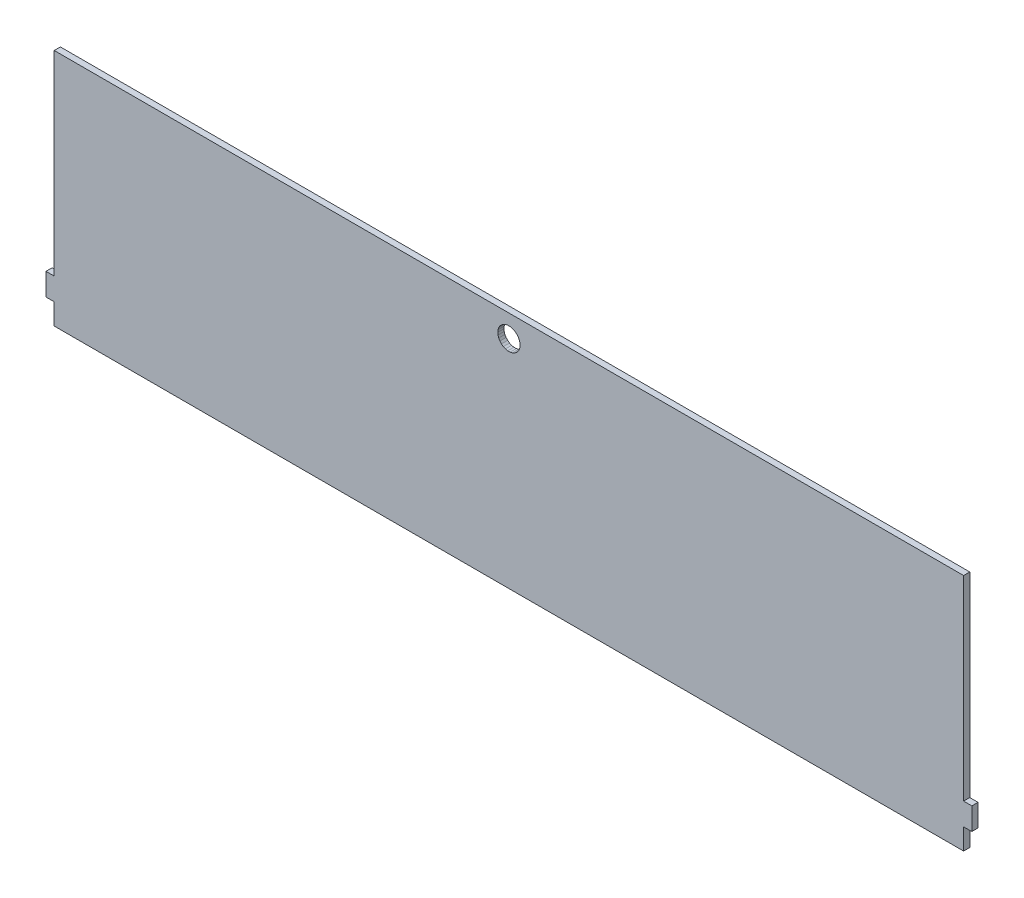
from build123d import *

# Parameters (mm, degrees)
BOSS_EXTRUDE2_DEPTH = 12


with BuildPart() as part:
    # Sketch4 → Boss-Extrude2 (new body)
    with BuildSketch(Plane.XY):
        Polygon((1648.8, 652.67), (1664.8, 652.67), (1664.8, 695.942), (1648.8, 695.942), (1648.8, 1075.802), (-119.2, 1075.802), (-119.2, 695.942), (-135.2, 695.942), (-135.2, 652.67), (-119.2, 652.67), (-119.2, 611.8), (1648.8, 611.8), align=None)
        Polygon((762.54, 1011.009), (758.11, 1011.95), (753.98, 1013.79), (750.32, 1016.448), (747.3, 1019.81), (745.03, 1023.727), (743.64, 1028.029), (743.16, 1032.527), (743.64, 1037.026), (745.03, 1041.328), (747.3, 1045.245), (750.32, 1048.606), (753.98, 1051.265), (758.11, 1053.105), (762.54, 1054.045), (767.06, 1054.045), (771.49, 1053.105), (775.62, 1051.265), (779.28, 1048.606), (782.3, 1045.245), (784.57, 1041.328), (785.96, 1037.026), (786.44, 1032.527), (785.96, 1028.029), (784.57, 1023.727), (782.3, 1019.81), (779.28, 1016.448), (775.62, 1013.79), (771.49, 1011.95), (767.06, 1011.009), align=None, mode=Mode.SUBTRACT)
    extrude(amount=BOSS_EXTRUDE2_DEPTH)


solid = part.part
